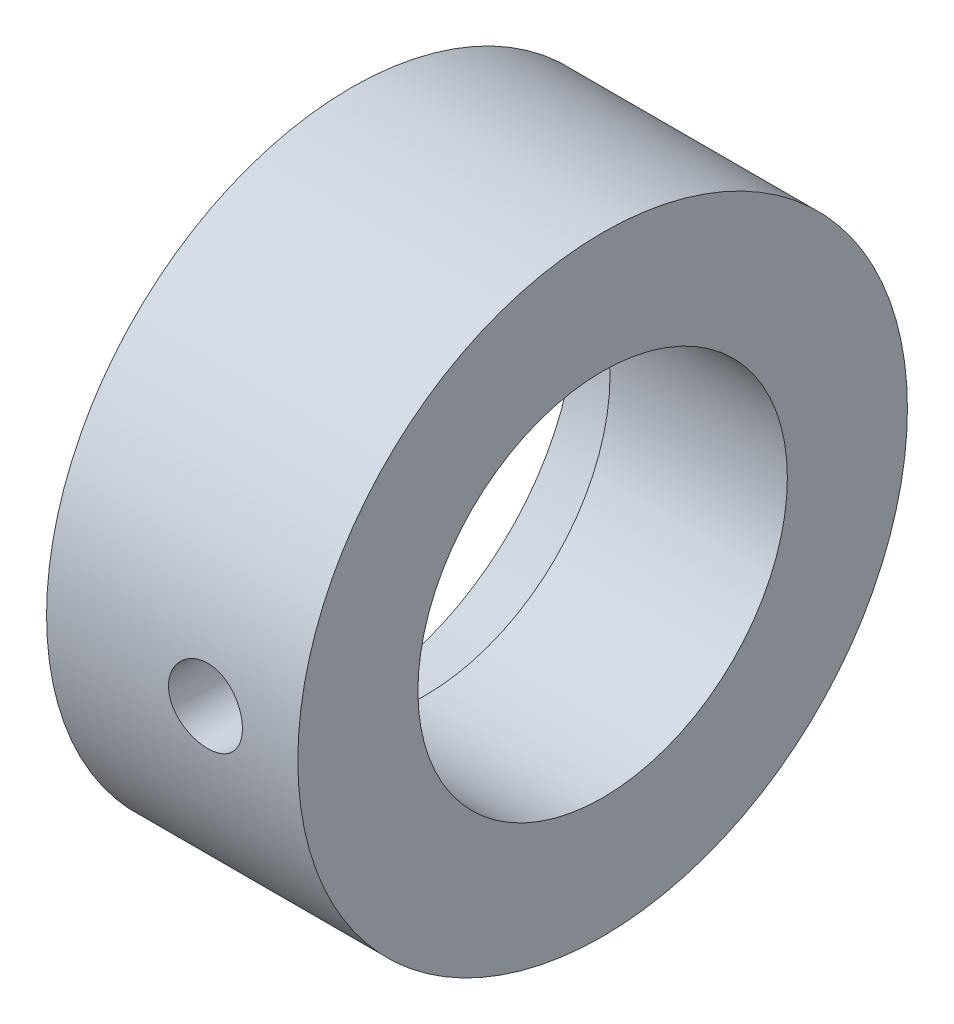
from build123d import *

# Parameters (mm, degrees)
ESQUISSE7_R             = 2
ENL_V_MAT_EXTRU_1_DEPTH = 20


with BuildPart() as part:
    # Esquisse1 → R_volution2 (revolve)
    with BuildSketch(Plane.XY, mode=Mode.PRIVATE) as r_volution2_sk:
        Polygon((13, 64.65), (13, 69), (26.6, 69), (26.6, 62.5), (17, 62.5), (17, 66.105880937), align=None)
    revolve(r_volution2_sk.sketch.rotate(Axis((8.581112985, 52.5, 0), (1, 0, 0)), 90), axis=Axis((8.581112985, 52.5, 0), (1, 0, 0)))

    # Esquisse7 → Enl_v. mat.-Extru.1 (cut)
    with BuildSketch(Plane.XY):
        with Locations(Location((21.6, 52.5, 0), (0, 0, 180))):
            Circle(ESQUISSE7_R)
    extrude(amount=ENL_V_MAT_EXTRU_1_DEPTH, mode=Mode.SUBTRACT)


solid = part.part
